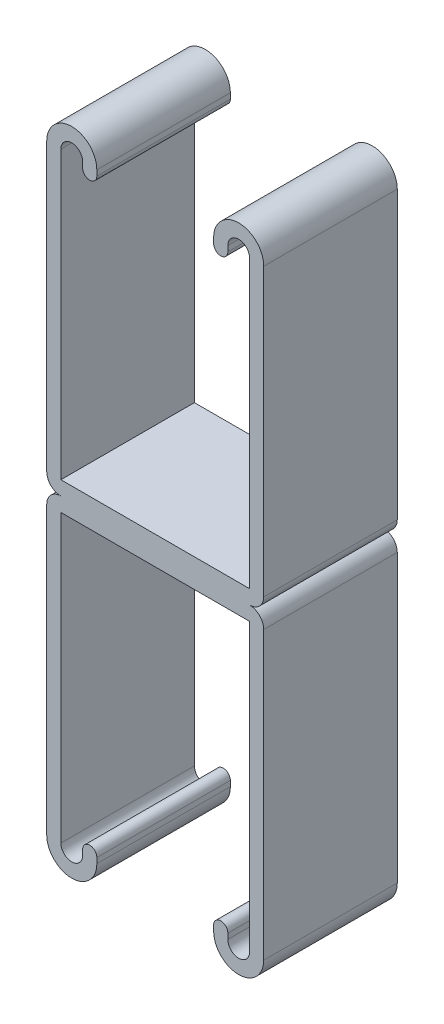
from build123d import *

# Parameters (mm, degrees)
BASE_EXTRUDE_DEPTH = 12.7


with BuildPart() as part:
    # Sketch1 → Base-Extrude (new, symmetric)
    with BuildSketch(Plane.XY):
        with BuildLine():
            Line((-20.6375, 57.15), (-20.6375, 2.6924))
            ThreePointArc((-20.6375, 2.6924), (-19.848914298, 0.788585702), (-17.9451, 0))
            Line((-17.9451, 0), (17.9451, 0))
            ThreePointArc((17.9451, 0), (19.848914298, 0.788585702), (20.6375, 2.6924))
            Line((20.6375, 2.6924), (20.6375, 57.15))
            ThreePointArc((20.6375, 57.15), (15.875, 61.9125), (11.1125, 57.15))
            Line((11.1125, 57.15), (11.1125, 56.11495))
            ThreePointArc((11.1125, 56.11495), (12.4587, 54.76875), (13.8049, 56.11495))
            Line((13.8049, 56.11495), (13.8049, 57.15))
            ThreePointArc((13.8049, 57.15), (15.875, 59.2201), (17.9451, 57.15))
            Line((17.9451, 57.15), (17.9451, 2.6924))
            Line((17.9451, 2.6924), (-17.9451, 2.6924))
            Line((-17.9451, 2.6924), (-17.9451, 57.15))
            ThreePointArc((-17.9451, 57.15), (-15.875, 59.2201), (-13.8049, 57.15))
            Line((-13.8049, 57.15), (-13.8049, 56.11495))
            ThreePointArc((-13.8049, 56.11495), (-12.4587, 54.76875), (-11.1125, 56.11495))
            Line((-11.1125, 56.11495), (-11.1125, 57.15))
            ThreePointArc((-11.1125, 57.15), (-15.875, 61.9125), (-20.6375, 57.15))
        make_face()
    base_extrude = extrude(amount=BASE_EXTRUDE_DEPTH, both=True)

    # Mirror1: Base-Extrude across plane
    add(base_extrude.mirror(Plane.ZX))


solid = part.part
